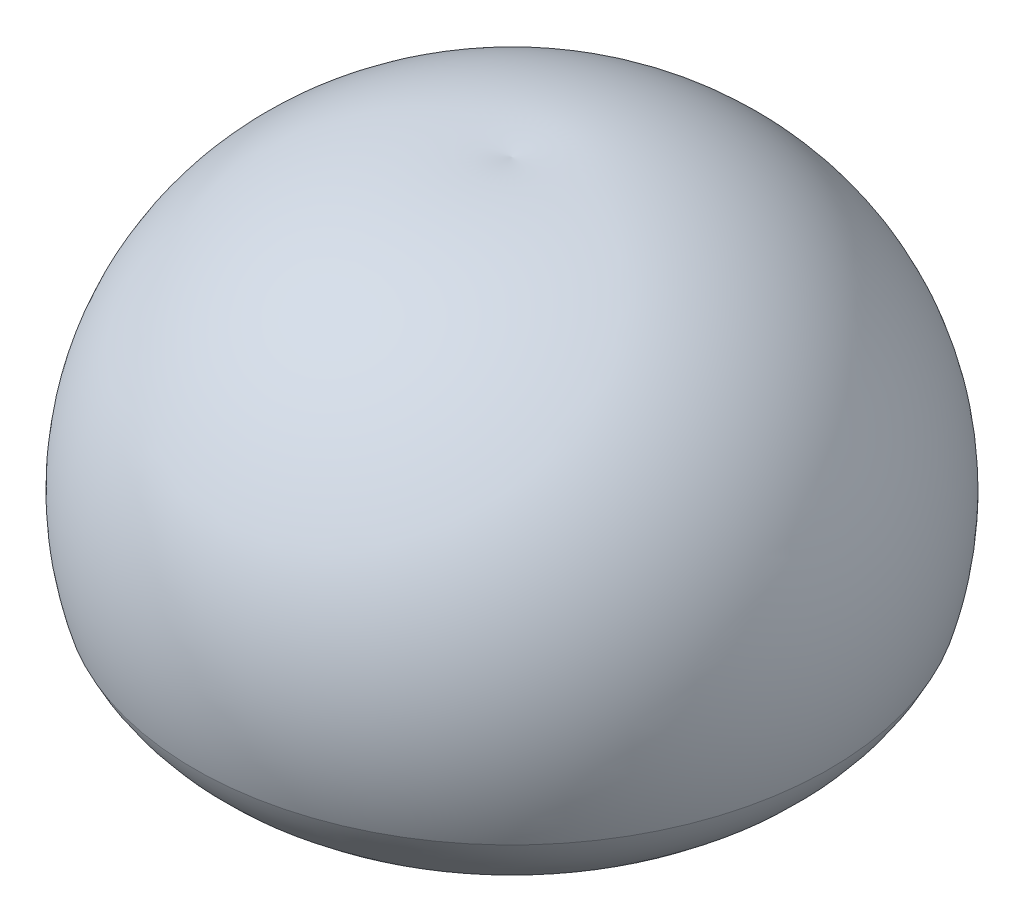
ISO-10303-21;
HEADER;
FILE_DESCRIPTION(('STEP AP214'),'2;1');
FILE_NAME('part.step','',(''),(''),'','','');
FILE_SCHEMA(('AUTOMOTIVE_DESIGN { 1 0 10303 214 1 1 1 1 }'));
ENDSEC;
DATA;
#1=APPLICATION_CONTEXT('core data for automotive mechanical design processes');
#2=APPLICATION_PROTOCOL_DEFINITION('international standard','automotive_design',2000,#1);
#3=PRODUCT_CONTEXT('',#1,'mechanical');
#4=PRODUCT('Part','Part','',(#3));
#5=PRODUCT_RELATED_PRODUCT_CATEGORY('part','',(#4));
#6=PRODUCT_DEFINITION_FORMATION('','',#4);
#7=PRODUCT_DEFINITION_CONTEXT('part definition',#1,'design');
#8=PRODUCT_DEFINITION('design','',#6,#7);
#9=PRODUCT_DEFINITION_SHAPE('','',#8);
#10=(LENGTH_UNIT() NAMED_UNIT(*) SI_UNIT(.MILLI.,.METRE.));
#11=(NAMED_UNIT(*) PLANE_ANGLE_UNIT() SI_UNIT($,.RADIAN.));
#12=(NAMED_UNIT(*) SI_UNIT($,.STERADIAN.) SOLID_ANGLE_UNIT());
#13=UNCERTAINTY_MEASURE_WITH_UNIT(LENGTH_MEASURE(1.E-05),#10,'distance_accuracy_value','');
#14=(GEOMETRIC_REPRESENTATION_CONTEXT(3) GLOBAL_UNCERTAINTY_ASSIGNED_CONTEXT((#13)) GLOBAL_UNIT_ASSIGNED_CONTEXT((#10,
#11,#12)) REPRESENTATION_CONTEXT('',''));
#15=CARTESIAN_POINT('',(0.,0.,0.));
#16=DIRECTION('',(0.,0.,1.));
#17=DIRECTION('',(1.,0.,0.));
#18=AXIS2_PLACEMENT_3D('',#15,#16,#17);
#19=CARTESIAN_POINT('',(0.,1130.23009231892,770.47395849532));
#20=DIRECTION('',(-1.,0.,0.));
#21=DIRECTION('',(0.,0.,-1.));
#22=AXIS2_PLACEMENT_3D('',#19,#20,#21);
#23=CIRCLE('',#22,1512.97757828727);
#24=TRIMMED_CURVE('',#23,(PARAMETER_VALUE(-1.03649081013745)),
(PARAMETER_VALUE(1.03649081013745)),.T.,.PARAMETER.);
#25=CARTESIAN_POINT('',(0.,1130.23009231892,0.));
#26=DIRECTION('',(0.,-1.,0.));
#27=AXIS1_PLACEMENT('',#25,#26);
#28=SURFACE_OF_REVOLUTION('',#24,#27);
#29=CARTESIAN_POINT('',(0.,2432.33263500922,0.));
#30=VERTEX_POINT('',#29);
#31=VERTEX_LOOP('',#30);
#32=FACE_BOUND('',#31,.T.);
#33=CARTESIAN_POINT('',(0.,1483.71031987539,0.));
#34=DIRECTION('',(0.,-1.,0.));
#35=DIRECTION('',(0.,0.,-1.));
#36=AXIS2_PLACEMENT_3D('',#33,#34,#35);
#37=CIRCLE('',#36,700.632047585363);
#38=CARTESIAN_POINT('',(0.,1483.71031987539,-700.632047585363));
#39=VERTEX_POINT('',#38);
#40=EDGE_CURVE('E34',#39,#39,#37,.T.);
#41=ORIENTED_EDGE('',*,*,#40,.T.);
#42=EDGE_LOOP('',(#41));
#43=FACE_BOUND('',#42,.T.);
#44=ADVANCED_FACE('F16',(#32,#43),#28,.F.);
#45=CARTESIAN_POINT('',(0.,830.,-350.));
#46=DIRECTION('',(-1.,0.,0.));
#47=DIRECTION('',(0.,0.,-1.));
#48=AXIS2_PLACEMENT_3D('',#45,#46,#47);
#49=CIRCLE('',#48,2631.11341038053);
#50=TRIMMED_CURVE('',#49,(PARAMETER_VALUE(-1.70421533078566)),
(PARAMETER_VALUE(1.70421533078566)),.T.,.PARAMETER.);
#51=CARTESIAN_POINT('',(0.,830.,0.));
#52=DIRECTION('',(0.,-1.,0.));
#53=AXIS1_PLACEMENT('',#51,#52);
#54=SURFACE_OF_REVOLUTION('',#50,#53);
#55=CARTESIAN_POINT('',(0.,77.8080626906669,0.));
#56=DIRECTION('',(0.,-1.,0.));
#57=DIRECTION('',(0.,0.,-1.));
#58=AXIS2_PLACEMENT_3D('',#55,#56,#57);
#59=CIRCLE('',#58,2871.30225632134);
#60=CARTESIAN_POINT('',(0.,77.8080626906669,-2871.30225632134));
#61=VERTEX_POINT('',#60);
#62=EDGE_CURVE('E10',#61,#61,#59,.T.);
#63=ORIENTED_EDGE('',*,*,#62,.F.);
#64=EDGE_LOOP('',(#63));
#65=FACE_BOUND('',#64,.T.);
#66=CARTESIAN_POINT('',(0.,3437.73038834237,0.));
#67=VERTEX_POINT('',#66);
#68=VERTEX_LOOP('',#67);
#69=FACE_BOUND('',#68,.T.);
#70=ADVANCED_FACE('F31',(#65,#69),#54,.T.);
#71=CARTESIAN_POINT('',(0.,728.899338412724,0.));
#72=DIRECTION('',(0.,-1.,0.));
#73=DIRECTION('',(0.,0.,-1.));
#74=AXIS2_PLACEMENT_3D('',#71,#72,#73);
#75=DEGENERATE_TOROIDAL_SURFACE('',#74,1505.58584978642,1512.97757828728,.T.);
#76=CARTESIAN_POINT('',(0.,-518.149717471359,0.));
#77=DIRECTION('',(0.,-1.,0.));
#78=DIRECTION('',(0.,0.,-1.));
#79=AXIS2_PLACEMENT_3D('',#76,#77,#78);
#80=CIRCLE('',#79,648.865472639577);
#81=CARTESIAN_POINT('',(0.,-518.149717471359,-648.865472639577));
#82=VERTEX_POINT('',#81);
#83=EDGE_CURVE('E23',#82,#82,#80,.T.);
#84=ORIENTED_EDGE('',*,*,#83,.F.);
#85=EDGE_LOOP('',(#84));
#86=FACE_BOUND('',#85,.T.);
#87=ORIENTED_EDGE('',*,*,#62,.T.);
#88=EDGE_LOOP('',(#87));
#89=FACE_BOUND('',#88,.T.);
#90=ADVANCED_FACE('F45',(#86,#89),#75,.T.);
#91=CARTESIAN_POINT('',(0.,-518.149717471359,0.));
#92=DIRECTION('',(0.,-1.,0.));
#93=DIRECTION('',(0.,0.,-1.));
#94=AXIS2_PLACEMENT_3D('',#91,#92,#93);
#95=CONICAL_SURFACE('',#94,648.865472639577,0.0173061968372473);
#96=CARTESIAN_POINT('',(0.,146.114486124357,0.));
#97=DIRECTION('',(0.,-1.,0.));
#98=DIRECTION('',(0.,0.,-1.));
#99=AXIS2_PLACEMENT_3D('',#96,#97,#98);
#100=CIRCLE('',#99,637.368437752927);
#101=CARTESIAN_POINT('',(0.,146.114486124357,-637.368437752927));
#102=VERTEX_POINT('',#101);
#103=EDGE_CURVE('E36',#102,#102,#100,.T.);
#104=ORIENTED_EDGE('',*,*,#103,.F.);
#105=EDGE_LOOP('',(#104));
#106=FACE_BOUND('',#105,.T.);
#107=ORIENTED_EDGE('',*,*,#83,.T.);
#108=EDGE_LOOP('',(#107));
#109=FACE_BOUND('',#108,.T.);
#110=ADVANCED_FACE('F43',(#106,#109),#95,.F.);
#111=CARTESIAN_POINT('',(0.,830.,0.));
#112=DIRECTION('',(0.,-1.,0.));
#113=DIRECTION('',(0.,0.,-1.));
#114=AXIS2_PLACEMENT_3D('',#111,#112,#113);
#115=DEGENERATE_TOROIDAL_SURFACE('',#114,350.,741.808610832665,.T.);
#116=ORIENTED_EDGE('',*,*,#40,.F.);
#117=EDGE_LOOP('',(#116));
#118=FACE_BOUND('',#117,.T.);
#119=ORIENTED_EDGE('',*,*,#103,.T.);
#120=EDGE_LOOP('',(#119));
#121=FACE_BOUND('',#120,.T.);
#122=ADVANCED_FACE('F59',(#118,#121),#115,.F.);
#123=CLOSED_SHELL('',(#44,#70,#90,#110,#122));
#124=MANIFOLD_SOLID_BREP('B1',#123);
#125=ADVANCED_BREP_SHAPE_REPRESENTATION('',(#18,#124),#14);
#126=SHAPE_DEFINITION_REPRESENTATION(#9,#125);
ENDSEC;
END-ISO-10303-21;
